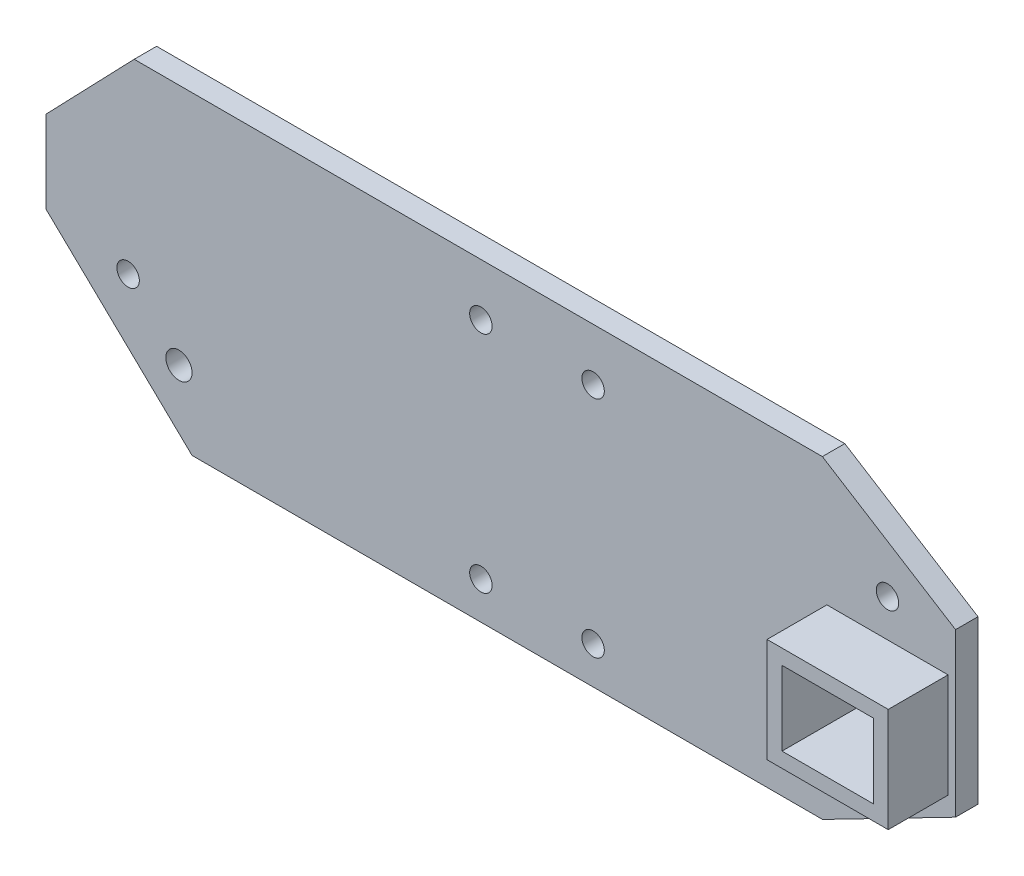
from build123d import *

# Parameters (mm, degrees)
BOSS_EXTRUDE1_DEPTH = 3
SKETCH2_R           = 1.5
SKETCH2_W           = 12.2
SKETCH2_H           = 9.93
CUT_EXTRUDE2_DEPTH  = 5
SKETCH4_R           = 1.5
CUT_EXTRUDE4_DEPTH  = 3
SKETCH6_R           = 1.7526
SKETCH6_R_2         = 1.5
CUT_EXTRUDE5_DEPTH  = 5
SKETCH7_W           = 16.2
SKETCH7_H           = 13.93
SKETCH7_W_2         = 12.2
SKETCH7_H_2         = 9.93
BOSS_EXTRUDE2_DEPTH = 8


with BuildPart() as part:
    # Sketch1 → Boss-Extrude1 (new body)
    with BuildSketch(Plane.XY):
        Polygon((-125.186603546, 38.874369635), (-33.186603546, 38.874369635), (-15.381249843, 27.740215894), (-15.381249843, 6.028295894), (-33.163376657, -3.125630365), (-117.453376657, -3.125630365), (-136.975246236, 15.625781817), (-136.975246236, 26.625781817), align=None)
    extrude(amount=BOSS_EXTRUDE1_DEPTH)

    # Sketch2 → Cut-Extrude2 (cut)
    with BuildSketch(Plane.XY.offset(3)):
        with Locations((-24.481249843, 27.009255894)):
            Circle(SKETCH2_R)
        with Locations((-24.481249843, 15.044255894)):
            Rectangle(SKETCH2_W, SKETCH2_H)
    extrude(amount=-CUT_EXTRUDE2_DEPTH, mode=Mode.SUBTRACT)

    # Sketch4 → Cut-Extrude4 (cut)
    with BuildSketch(Plane(origin=(0, 0, 0), x_dir=(-1, 0, 0), z_dir=(0, 0, -1))):
        with Locations((63.836603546, 31.874369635)):
            Circle(SKETCH4_R)
        with Locations((78.836603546, 31.874369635)):
            Circle(SKETCH4_R)
        with Locations((63.836603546, 1.874369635)):
            Circle(SKETCH4_R)
        with Locations((78.836603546, 1.874369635)):
            Circle(SKETCH4_R)
    extrude(amount=-CUT_EXTRUDE4_DEPTH, mode=Mode.SUBTRACT)

    # Sketch6 → Cut-Extrude5 (cut)
    with BuildSketch(Plane(origin=(0, 0, 0), x_dir=(-1, 0, 0), z_dir=(0, 0, -1))):
        with Locations((119.199076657, 6.444369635)):
            Circle(SKETCH6_R)
        with Locations((125.998946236, 13.590281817)):
            Circle(SKETCH6_R_2)
    extrude(amount=-CUT_EXTRUDE5_DEPTH, mode=Mode.SUBTRACT)

    # Sketch7 → Boss-Extrude2 (add)
    with BuildSketch(Plane.XY.offset(3)):
        with Locations((-24.481249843, 15.044255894)):
            Rectangle(SKETCH7_W, SKETCH7_H)
        with Locations((-24.481249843, 15.044255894)):
            Rectangle(SKETCH7_W_2, SKETCH7_H_2, mode=Mode.SUBTRACT)
    extrude(amount=BOSS_EXTRUDE2_DEPTH)


solid = part.part
